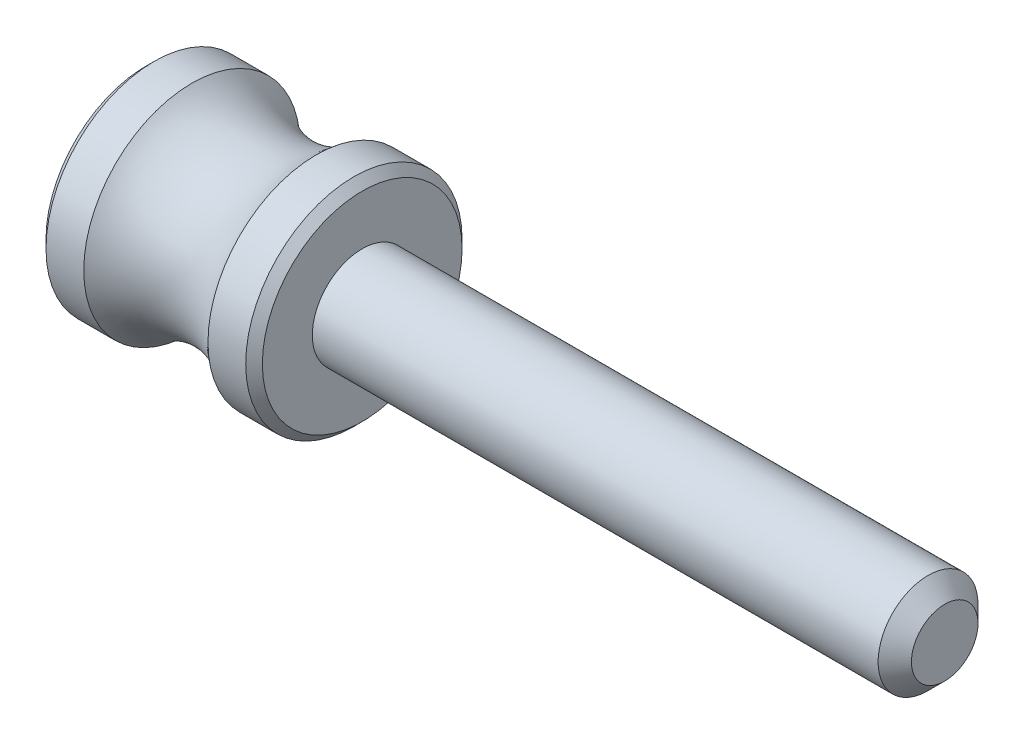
from build123d import *

# Parameters (mm, degrees)
SKETCH3_R           = 6.5
BOSS_EXTRUDE1_DEPTH = 13
CHAMFER1_SIZE       = 0.5
SKETCH5_R           = 3
BOSS_EXTRUDE2_DEPTH = 35
CHAMFER2_SIZE       = 1


with BuildPart() as part:
    # Sketch3 → Boss-Extrude1 (new body)
    with BuildSketch(Plane(origin=(0, 0, 0), x_dir=(0, 0, -1), z_dir=(1, 0, 0))):
        with Locations(Location((0, 0, 0), (0, 0, 180))):
            Circle(SKETCH3_R)
    extrude(amount=BOSS_EXTRUDE1_DEPTH)

    # Sketch4 → Cut-Revolve1 (revolve, cut)
    with BuildSketch(Plane.XY, mode=Mode.PRIVATE) as cut_revolve1_sk:
        with BuildLine():
            Line((2.767872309, 6.5), (10.232127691, 6.5))
            ThreePointArc((10.232127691, 6.5), (6.5, 5.02928002), (2.767872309, 6.5))
        make_face()
    revolve(cut_revolve1_sk.sketch.rotate(Axis((-1.687625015, 0, 0), (1, 0, 0)), 90), axis=Axis((-1.687625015, 0, 0), (1, 0, 0)), mode=Mode.SUBTRACT)

    # Chamfer1
    chamfer1_edges = [part.edges().sort_by_distance(p)[0] for p in [
        (0, 0, -6.5),
        (13, 0, -6.5),
    ]]
    chamfer(chamfer1_edges, length=CHAMFER1_SIZE)

    # Sketch5 → Boss-Extrude2 (add)
    with BuildSketch(Plane(origin=(13, 0, 0), x_dir=(0, 0, -1), z_dir=(1, 0, 0))):
        Circle(SKETCH5_R)
    extrude(amount=BOSS_EXTRUDE2_DEPTH)

    # Chamfer2
    chamfer2_edges = [part.edges().sort_by_distance(p)[0] for p in [
        (48, 0, 3),
    ]]
    chamfer(chamfer2_edges, length=CHAMFER2_SIZE)


solid = part.part
